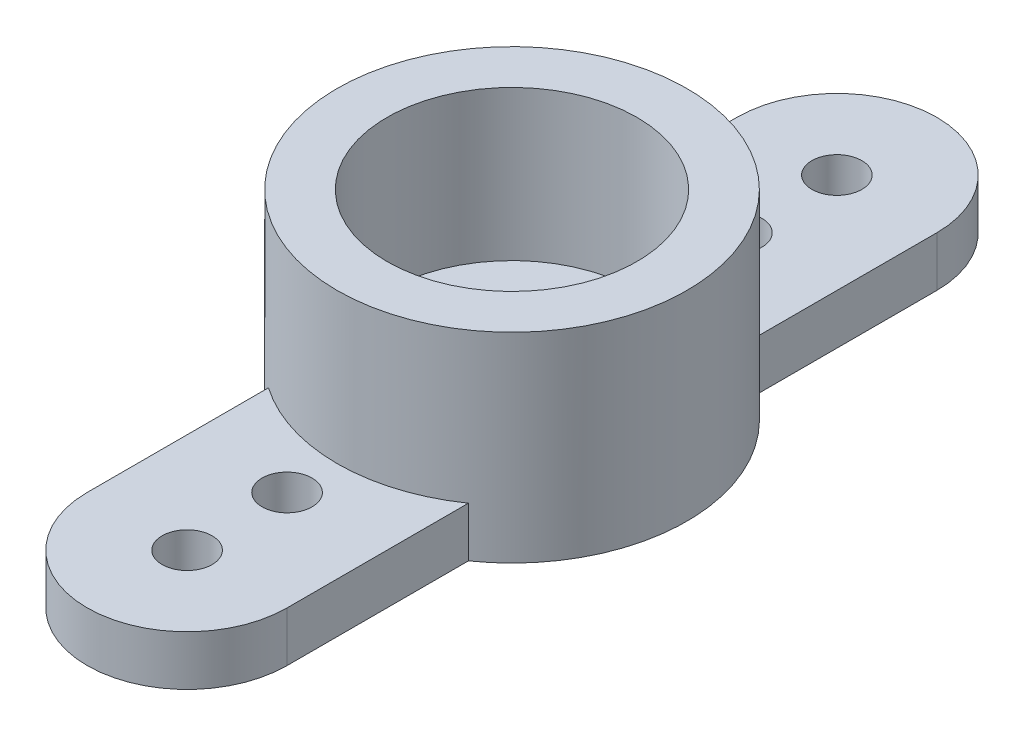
ISO-10303-21;
HEADER;
FILE_DESCRIPTION(('STEP AP214'),'2;1');
FILE_NAME('part.step','',(''),(''),'','','');
FILE_SCHEMA(('AUTOMOTIVE_DESIGN { 1 0 10303 214 1 1 1 1 }'));
ENDSEC;
DATA;
#1=APPLICATION_CONTEXT('core data for automotive mechanical design processes');
#2=APPLICATION_PROTOCOL_DEFINITION('international standard','automotive_design',2000,#1);
#3=PRODUCT_CONTEXT('',#1,'mechanical');
#4=PRODUCT('Part','Part','',(#3));
#5=PRODUCT_RELATED_PRODUCT_CATEGORY('part','',(#4));
#6=PRODUCT_DEFINITION_FORMATION('','',#4);
#7=PRODUCT_DEFINITION_CONTEXT('part definition',#1,'design');
#8=PRODUCT_DEFINITION('design','',#6,#7);
#9=PRODUCT_DEFINITION_SHAPE('','',#8);
#10=(LENGTH_UNIT() NAMED_UNIT(*) SI_UNIT(.MILLI.,.METRE.));
#11=(NAMED_UNIT(*) PLANE_ANGLE_UNIT() SI_UNIT($,.RADIAN.));
#12=(NAMED_UNIT(*) SI_UNIT($,.STERADIAN.) SOLID_ANGLE_UNIT());
#13=UNCERTAINTY_MEASURE_WITH_UNIT(LENGTH_MEASURE(1.E-05),#10,'distance_accuracy_value','');
#14=(GEOMETRIC_REPRESENTATION_CONTEXT(3) GLOBAL_UNCERTAINTY_ASSIGNED_CONTEXT((#13)) GLOBAL_UNIT_ASSIGNED_CONTEXT((#10,
#11,#12)) REPRESENTATION_CONTEXT('',''));
#15=CARTESIAN_POINT('',(0.,0.,0.));
#16=DIRECTION('',(0.,0.,1.));
#17=DIRECTION('',(1.,0.,0.));
#18=AXIS2_PLACEMENT_3D('',#15,#16,#17);
#19=CARTESIAN_POINT('',(0.,4.,0.));
#20=DIRECTION('',(0.,-1.,0.));
#21=DIRECTION('',(0.,0.,-1.));
#22=AXIS2_PLACEMENT_3D('',#19,#20,#21);
#23=CYLINDRICAL_SURFACE('',#22,3.5);
#24=CARTESIAN_POINT('',(0.,4.,0.));
#25=DIRECTION('',(0.,1.,0.));
#26=DIRECTION('',(0.,0.,1.));
#27=AXIS2_PLACEMENT_3D('',#24,#25,#26);
#28=CIRCLE('',#27,3.5);
#29=CARTESIAN_POINT('',(0.,4.,3.5));
#30=VERTEX_POINT('',#29);
#31=EDGE_CURVE('E40',#30,#30,#28,.T.);
#32=ORIENTED_EDGE('',*,*,#31,.F.);
#33=EDGE_LOOP('',(#32));
#34=FACE_BOUND('',#33,.T.);
#35=DIRECTION('',(0.,-1.,0.));
#36=VECTOR('',#35,1.);
#37=CARTESIAN_POINT('',(2.,1.,2.87228132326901));
#38=LINE('',#37,#36);
#39=CARTESIAN_POINT('',(2.,1.,2.87228132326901));
#40=VERTEX_POINT('',#39);
#41=CARTESIAN_POINT('',(2.,0.,2.87228132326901));
#42=VERTEX_POINT('',#41);
#43=EDGE_CURVE('E103',#40,#42,#38,.T.);
#44=ORIENTED_EDGE('',*,*,#43,.T.);
#45=CARTESIAN_POINT('',(0.,0.,0.));
#46=DIRECTION('',(0.,1.,0.));
#47=DIRECTION('',(0.,0.,1.));
#48=AXIS2_PLACEMENT_3D('',#45,#46,#47);
#49=CIRCLE('',#48,3.5);
#50=CARTESIAN_POINT('',(2.,0.,-2.87228132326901));
#51=VERTEX_POINT('',#50);
#52=EDGE_CURVE('E155',#42,#51,#49,.T.);
#53=ORIENTED_EDGE('',*,*,#52,.T.);
#54=DIRECTION('',(0.,-1.,0.));
#55=VECTOR('',#54,1.);
#56=CARTESIAN_POINT('',(2.,1.,-2.87228132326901));
#57=LINE('',#56,#55);
#58=CARTESIAN_POINT('',(2.,1.,-2.87228132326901));
#59=VERTEX_POINT('',#58);
#60=EDGE_CURVE('E149',#59,#51,#57,.T.);
#61=ORIENTED_EDGE('',*,*,#60,.F.);
#62=CARTESIAN_POINT('',(0.,1.,0.));
#63=DIRECTION('',(0.,-1.,0.));
#64=DIRECTION('',(0.,0.,1.));
#65=AXIS2_PLACEMENT_3D('',#62,#63,#64);
#66=CIRCLE('',#65,3.5);
#67=CARTESIAN_POINT('',(-2.,1.,-2.87228132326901));
#68=VERTEX_POINT('',#67);
#69=EDGE_CURVE('E126',#68,#59,#66,.T.);
#70=ORIENTED_EDGE('',*,*,#69,.F.);
#71=DIRECTION('',(0.,-1.,0.));
#72=VECTOR('',#71,1.);
#73=CARTESIAN_POINT('',(-2.,1.,-2.87228132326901));
#74=LINE('',#73,#72);
#75=CARTESIAN_POINT('',(-2.,0.,-2.87228132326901));
#76=VERTEX_POINT('',#75);
#77=EDGE_CURVE('E136',#68,#76,#74,.T.);
#78=ORIENTED_EDGE('',*,*,#77,.T.);
#79=CARTESIAN_POINT('',(-2.,0.,2.87228132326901));
#80=VERTEX_POINT('',#79);
#81=EDGE_CURVE('E157',#76,#80,#49,.T.);
#82=ORIENTED_EDGE('',*,*,#81,.T.);
#83=DIRECTION('',(0.,-1.,0.));
#84=VECTOR('',#83,1.);
#85=CARTESIAN_POINT('',(-2.,1.,2.87228132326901));
#86=LINE('',#85,#84);
#87=CARTESIAN_POINT('',(-2.,1.,2.87228132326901));
#88=VERTEX_POINT('',#87);
#89=EDGE_CURVE('E52',#88,#80,#86,.T.);
#90=ORIENTED_EDGE('',*,*,#89,.F.);
#91=CARTESIAN_POINT('',(0.,1.,0.));
#92=DIRECTION('',(0.,-1.,0.));
#93=DIRECTION('',(0.,0.,1.));
#94=AXIS2_PLACEMENT_3D('',#91,#92,#93);
#95=CIRCLE('',#94,3.5);
#96=EDGE_CURVE('E47',#40,#88,#95,.T.);
#97=ORIENTED_EDGE('',*,*,#96,.F.);
#98=EDGE_LOOP('',(#44,#53,#61,#70,#78,#82,#90,#97));
#99=FACE_BOUND('',#98,.T.);
#100=ADVANCED_FACE('F33',(#34,#99),#23,.T.);
#101=CARTESIAN_POINT('',(0.,4.,0.));
#102=DIRECTION('',(0.,1.,0.));
#103=DIRECTION('',(0.,0.,1.));
#104=AXIS2_PLACEMENT_3D('',#101,#102,#103);
#105=PLANE('',#104);
#106=ORIENTED_EDGE('',*,*,#31,.T.);
#107=EDGE_LOOP('',(#106));
#108=FACE_BOUND('',#107,.T.);
#109=CARTESIAN_POINT('',(0.,4.,0.));
#110=DIRECTION('',(0.,1.,0.));
#111=DIRECTION('',(0.,0.,1.));
#112=AXIS2_PLACEMENT_3D('',#109,#110,#111);
#113=CIRCLE('',#112,2.5);
#114=CARTESIAN_POINT('',(0.,4.,2.5));
#115=VERTEX_POINT('',#114);
#116=EDGE_CURVE('E152',#115,#115,#113,.T.);
#117=ORIENTED_EDGE('',*,*,#116,.F.);
#118=EDGE_LOOP('',(#117));
#119=FACE_BOUND('',#118,.T.);
#120=ADVANCED_FACE('F229',(#108,#119),#105,.T.);
#121=CARTESIAN_POINT('',(0.,0.,0.));
#122=DIRECTION('',(0.,1.,0.));
#123=DIRECTION('',(0.,0.,1.));
#124=AXIS2_PLACEMENT_3D('',#121,#122,#123);
#125=PLANE('',#124);
#126=CARTESIAN_POINT('',(0.,0.,-6.5));
#127=DIRECTION('',(0.,1.,0.));
#128=DIRECTION('',(0.,0.,1.));
#129=AXIS2_PLACEMENT_3D('',#126,#127,#128);
#130=CIRCLE('',#129,0.5);
#131=CARTESIAN_POINT('',(0.,0.,-6.));
#132=VERTEX_POINT('',#131);
#133=EDGE_CURVE('E186',#132,#132,#130,.T.);
#134=ORIENTED_EDGE('',*,*,#133,.T.);
#135=EDGE_LOOP('',(#134));
#136=FACE_BOUND('',#135,.T.);
#137=CARTESIAN_POINT('',(0.,0.,-4.5));
#138=DIRECTION('',(0.,1.,0.));
#139=DIRECTION('',(0.,0.,1.));
#140=AXIS2_PLACEMENT_3D('',#137,#138,#139);
#141=CIRCLE('',#140,0.5);
#142=CARTESIAN_POINT('',(0.,0.,-4.));
#143=VERTEX_POINT('',#142);
#144=EDGE_CURVE('E193',#143,#143,#141,.T.);
#145=ORIENTED_EDGE('',*,*,#144,.T.);
#146=EDGE_LOOP('',(#145));
#147=FACE_BOUND('',#146,.T.);
#148=CARTESIAN_POINT('',(0.,0.,4.5));
#149=DIRECTION('',(0.,1.,0.));
#150=DIRECTION('',(0.,0.,-1.));
#151=AXIS2_PLACEMENT_3D('',#148,#149,#150);
#152=CIRCLE('',#151,0.5);
#153=CARTESIAN_POINT('',(0.,0.,4.));
#154=VERTEX_POINT('',#153);
#155=EDGE_CURVE('E201',#154,#154,#152,.T.);
#156=ORIENTED_EDGE('',*,*,#155,.T.);
#157=EDGE_LOOP('',(#156));
#158=FACE_BOUND('',#157,.T.);
#159=CARTESIAN_POINT('',(0.,0.,6.5));
#160=DIRECTION('',(0.,1.,0.));
#161=DIRECTION('',(0.,0.,-1.));
#162=AXIS2_PLACEMENT_3D('',#159,#160,#161);
#163=CIRCLE('',#162,0.5);
#164=CARTESIAN_POINT('',(0.,0.,6.));
#165=VERTEX_POINT('',#164);
#166=EDGE_CURVE('E207',#165,#165,#163,.T.);
#167=ORIENTED_EDGE('',*,*,#166,.T.);
#168=EDGE_LOOP('',(#167));
#169=FACE_BOUND('',#168,.T.);
#170=ORIENTED_EDGE('',*,*,#81,.F.);
#171=DIRECTION('',(0.,0.,1.));
#172=VECTOR('',#171,1.);
#173=CARTESIAN_POINT('',(-2.,0.,-2.87228132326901));
#174=LINE('',#173,#172);
#175=CARTESIAN_POINT('',(-2.,0.,-6.5));
#176=VERTEX_POINT('',#175);
#177=EDGE_CURVE('E130',#176,#76,#174,.T.);
#178=ORIENTED_EDGE('',*,*,#177,.F.);
#179=CARTESIAN_POINT('',(0.,0.,-6.5));
#180=DIRECTION('',(0.,1.,0.));
#181=DIRECTION('',(0.,0.,-1.));
#182=AXIS2_PLACEMENT_3D('',#179,#180,#181);
#183=CIRCLE('',#182,2.);
#184=CARTESIAN_POINT('',(2.,0.,-6.5));
#185=VERTEX_POINT('',#184);
#186=EDGE_CURVE('E121',#185,#176,#183,.T.);
#187=ORIENTED_EDGE('',*,*,#186,.F.);
#188=DIRECTION('',(0.,0.,-1.));
#189=VECTOR('',#188,1.);
#190=CARTESIAN_POINT('',(2.,0.,-6.5));
#191=LINE('',#190,#189);
#192=EDGE_CURVE('E119',#51,#185,#191,.T.);
#193=ORIENTED_EDGE('',*,*,#192,.F.);
#194=ORIENTED_EDGE('',*,*,#52,.F.);
#195=DIRECTION('',(0.,0.,-1.));
#196=VECTOR('',#195,1.);
#197=CARTESIAN_POINT('',(2.,0.,6.5));
#198=LINE('',#197,#196);
#199=CARTESIAN_POINT('',(2.,0.,6.5));
#200=VERTEX_POINT('',#199);
#201=EDGE_CURVE('E177',#200,#42,#198,.T.);
#202=ORIENTED_EDGE('',*,*,#201,.F.);
#203=CARTESIAN_POINT('',(0.,0.,6.5));
#204=DIRECTION('',(0.,1.,0.));
#205=DIRECTION('',(0.,0.,1.));
#206=AXIS2_PLACEMENT_3D('',#203,#204,#205);
#207=CIRCLE('',#206,2.);
#208=CARTESIAN_POINT('',(-2.,0.,6.5));
#209=VERTEX_POINT('',#208);
#210=EDGE_CURVE('E118',#209,#200,#207,.T.);
#211=ORIENTED_EDGE('',*,*,#210,.F.);
#212=DIRECTION('',(0.,0.,1.));
#213=VECTOR('',#212,1.);
#214=CARTESIAN_POINT('',(-2.,0.,2.87228132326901));
#215=LINE('',#214,#213);
#216=EDGE_CURVE('E114',#80,#209,#215,.T.);
#217=ORIENTED_EDGE('',*,*,#216,.F.);
#218=EDGE_LOOP('',(#170,#178,#187,#193,#194,#202,#211,#217));
#219=FACE_BOUND('',#218,.T.);
#220=ADVANCED_FACE('F162',(#136,#147,#158,#169,#219),#125,.F.);
#221=CARTESIAN_POINT('',(0.,4.,0.));
#222=DIRECTION('',(0.,-1.,0.));
#223=DIRECTION('',(0.,0.,-1.));
#224=AXIS2_PLACEMENT_3D('',#221,#222,#223);
#225=CYLINDRICAL_SURFACE('',#224,2.5);
#226=CARTESIAN_POINT('',(0.,1.,0.));
#227=DIRECTION('',(0.,1.,0.));
#228=DIRECTION('',(0.,0.,1.));
#229=AXIS2_PLACEMENT_3D('',#226,#227,#228);
#230=CIRCLE('',#229,2.5);
#231=CARTESIAN_POINT('',(0.,1.,2.5));
#232=VERTEX_POINT('',#231);
#233=EDGE_CURVE('E11',#232,#232,#230,.T.);
#234=ORIENTED_EDGE('',*,*,#233,.F.);
#235=EDGE_LOOP('',(#234));
#236=FACE_BOUND('',#235,.T.);
#237=ORIENTED_EDGE('',*,*,#116,.T.);
#238=EDGE_LOOP('',(#237));
#239=FACE_BOUND('',#238,.T.);
#240=ADVANCED_FACE('F240',(#236,#239),#225,.F.);
#241=CARTESIAN_POINT('',(2.,1.,-6.5));
#242=DIRECTION('',(-1.,0.,0.));
#243=DIRECTION('',(0.,0.,1.));
#244=AXIS2_PLACEMENT_3D('',#241,#242,#243);
#245=PLANE('',#244);
#246=ORIENTED_EDGE('',*,*,#192,.T.);
#247=DIRECTION('',(0.,-1.,0.));
#248=VECTOR('',#247,1.);
#249=CARTESIAN_POINT('',(2.,1.,-6.5));
#250=LINE('',#249,#248);
#251=CARTESIAN_POINT('',(2.,1.,-6.5));
#252=VERTEX_POINT('',#251);
#253=EDGE_CURVE('E146',#252,#185,#250,.T.);
#254=ORIENTED_EDGE('',*,*,#253,.F.);
#255=DIRECTION('',(0.,0.,-1.));
#256=VECTOR('',#255,1.);
#257=CARTESIAN_POINT('',(2.,1.,-6.5));
#258=LINE('',#257,#256);
#259=EDGE_CURVE('E129',#59,#252,#258,.T.);
#260=ORIENTED_EDGE('',*,*,#259,.F.);
#261=ORIENTED_EDGE('',*,*,#60,.T.);
#262=EDGE_LOOP('',(#246,#254,#260,#261));
#263=FACE_BOUND('',#262,.T.);
#264=ADVANCED_FACE('F166',(#263),#245,.F.);
#265=CARTESIAN_POINT('',(0.,1.,-6.5));
#266=DIRECTION('',(0.,-1.,0.));
#267=DIRECTION('',(0.,0.,-1.));
#268=AXIS2_PLACEMENT_3D('',#265,#266,#267);
#269=CYLINDRICAL_SURFACE('',#268,2.);
#270=ORIENTED_EDGE('',*,*,#186,.T.);
#271=DIRECTION('',(0.,-1.,0.));
#272=VECTOR('',#271,1.);
#273=CARTESIAN_POINT('',(-2.,1.,-6.5));
#274=LINE('',#273,#272);
#275=CARTESIAN_POINT('',(-2.,1.,-6.5));
#276=VERTEX_POINT('',#275);
#277=EDGE_CURVE('E143',#276,#176,#274,.T.);
#278=ORIENTED_EDGE('',*,*,#277,.F.);
#279=CARTESIAN_POINT('',(0.,1.,-6.5));
#280=DIRECTION('',(0.,1.,0.));
#281=DIRECTION('',(0.,0.,-1.));
#282=AXIS2_PLACEMENT_3D('',#279,#280,#281);
#283=CIRCLE('',#282,2.);
#284=EDGE_CURVE('E132',#252,#276,#283,.T.);
#285=ORIENTED_EDGE('',*,*,#284,.F.);
#286=ORIENTED_EDGE('',*,*,#253,.T.);
#287=EDGE_LOOP('',(#270,#278,#285,#286));
#288=FACE_BOUND('',#287,.T.);
#289=ADVANCED_FACE('F248',(#288),#269,.T.);
#290=CARTESIAN_POINT('',(-2.,1.,-2.87228132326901));
#291=DIRECTION('',(1.,0.,0.));
#292=DIRECTION('',(0.,0.,-1.));
#293=AXIS2_PLACEMENT_3D('',#290,#291,#292);
#294=PLANE('',#293);
#295=ORIENTED_EDGE('',*,*,#177,.T.);
#296=ORIENTED_EDGE('',*,*,#77,.F.);
#297=DIRECTION('',(0.,0.,1.));
#298=VECTOR('',#297,1.);
#299=CARTESIAN_POINT('',(-2.,1.,-2.87228132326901));
#300=LINE('',#299,#298);
#301=EDGE_CURVE('E134',#276,#68,#300,.T.);
#302=ORIENTED_EDGE('',*,*,#301,.F.);
#303=ORIENTED_EDGE('',*,*,#277,.T.);
#304=EDGE_LOOP('',(#295,#296,#302,#303));
#305=FACE_BOUND('',#304,.T.);
#306=ADVANCED_FACE('F173',(#305),#294,.F.);
#307=CARTESIAN_POINT('',(0.,1.,0.));
#308=DIRECTION('',(0.,1.,0.));
#309=DIRECTION('',(0.,0.,1.));
#310=AXIS2_PLACEMENT_3D('',#307,#308,#309);
#311=PLANE('',#310);
#312=CARTESIAN_POINT('',(0.,1.,-6.5));
#313=DIRECTION('',(0.,1.,0.));
#314=DIRECTION('',(0.,0.,1.));
#315=AXIS2_PLACEMENT_3D('',#312,#313,#314);
#316=CIRCLE('',#315,0.5);
#317=CARTESIAN_POINT('',(0.,1.,-6.));
#318=VERTEX_POINT('',#317);
#319=EDGE_CURVE('E188',#318,#318,#316,.T.);
#320=ORIENTED_EDGE('',*,*,#319,.F.);
#321=EDGE_LOOP('',(#320));
#322=FACE_BOUND('',#321,.T.);
#323=CARTESIAN_POINT('',(0.,1.,-4.5));
#324=DIRECTION('',(0.,1.,0.));
#325=DIRECTION('',(0.,0.,1.));
#326=AXIS2_PLACEMENT_3D('',#323,#324,#325);
#327=CIRCLE('',#326,0.5);
#328=CARTESIAN_POINT('',(0.,1.,-4.));
#329=VERTEX_POINT('',#328);
#330=EDGE_CURVE('E198',#329,#329,#327,.T.);
#331=ORIENTED_EDGE('',*,*,#330,.F.);
#332=EDGE_LOOP('',(#331));
#333=FACE_BOUND('',#332,.T.);
#334=ORIENTED_EDGE('',*,*,#69,.T.);
#335=ORIENTED_EDGE('',*,*,#259,.T.);
#336=ORIENTED_EDGE('',*,*,#284,.T.);
#337=ORIENTED_EDGE('',*,*,#301,.T.);
#338=EDGE_LOOP('',(#334,#335,#336,#337));
#339=FACE_BOUND('',#338,.T.);
#340=ADVANCED_FACE('F169',(#322,#333,#339),#311,.T.);
#341=CARTESIAN_POINT('',(0.,1.,6.5));
#342=DIRECTION('',(0.,-1.,0.));
#343=DIRECTION('',(0.,0.,-1.));
#344=AXIS2_PLACEMENT_3D('',#341,#342,#343);
#345=CYLINDRICAL_SURFACE('',#344,2.);
#346=ORIENTED_EDGE('',*,*,#210,.T.);
#347=DIRECTION('',(0.,-1.,0.));
#348=VECTOR('',#347,1.);
#349=CARTESIAN_POINT('',(2.,1.,6.5));
#350=LINE('',#349,#348);
#351=CARTESIAN_POINT('',(2.,1.,6.5));
#352=VERTEX_POINT('',#351);
#353=EDGE_CURVE('E101',#352,#200,#350,.T.);
#354=ORIENTED_EDGE('',*,*,#353,.F.);
#355=CARTESIAN_POINT('',(0.,1.,6.5));
#356=DIRECTION('',(0.,1.,0.));
#357=DIRECTION('',(0.,0.,1.));
#358=AXIS2_PLACEMENT_3D('',#355,#356,#357);
#359=CIRCLE('',#358,2.);
#360=CARTESIAN_POINT('',(-2.,1.,6.5));
#361=VERTEX_POINT('',#360);
#362=EDGE_CURVE('E105',#361,#352,#359,.T.);
#363=ORIENTED_EDGE('',*,*,#362,.F.);
#364=DIRECTION('',(0.,-1.,0.));
#365=VECTOR('',#364,1.);
#366=CARTESIAN_POINT('',(-2.,1.,6.5));
#367=LINE('',#366,#365);
#368=EDGE_CURVE('E182',#361,#209,#367,.T.);
#369=ORIENTED_EDGE('',*,*,#368,.T.);
#370=EDGE_LOOP('',(#346,#354,#363,#369));
#371=FACE_BOUND('',#370,.T.);
#372=ADVANCED_FACE('F116',(#371),#345,.T.);
#373=CARTESIAN_POINT('',(2.,1.,6.5));
#374=DIRECTION('',(-1.,0.,0.));
#375=DIRECTION('',(0.,0.,1.));
#376=AXIS2_PLACEMENT_3D('',#373,#374,#375);
#377=PLANE('',#376);
#378=ORIENTED_EDGE('',*,*,#201,.T.);
#379=ORIENTED_EDGE('',*,*,#43,.F.);
#380=DIRECTION('',(0.,0.,-1.));
#381=VECTOR('',#380,1.);
#382=CARTESIAN_POINT('',(2.,1.,6.5));
#383=LINE('',#382,#381);
#384=EDGE_CURVE('E96',#352,#40,#383,.T.);
#385=ORIENTED_EDGE('',*,*,#384,.F.);
#386=ORIENTED_EDGE('',*,*,#353,.T.);
#387=EDGE_LOOP('',(#378,#379,#385,#386));
#388=FACE_BOUND('',#387,.T.);
#389=ADVANCED_FACE('F99',(#388),#377,.F.);
#390=CARTESIAN_POINT('',(-2.,1.,2.87228132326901));
#391=DIRECTION('',(1.,0.,0.));
#392=DIRECTION('',(0.,0.,-1.));
#393=AXIS2_PLACEMENT_3D('',#390,#391,#392);
#394=PLANE('',#393);
#395=ORIENTED_EDGE('',*,*,#216,.T.);
#396=ORIENTED_EDGE('',*,*,#368,.F.);
#397=DIRECTION('',(0.,0.,1.));
#398=VECTOR('',#397,1.);
#399=CARTESIAN_POINT('',(-2.,1.,2.87228132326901));
#400=LINE('',#399,#398);
#401=EDGE_CURVE('E110',#88,#361,#400,.T.);
#402=ORIENTED_EDGE('',*,*,#401,.F.);
#403=ORIENTED_EDGE('',*,*,#89,.T.);
#404=EDGE_LOOP('',(#395,#396,#402,#403));
#405=FACE_BOUND('',#404,.T.);
#406=ADVANCED_FACE('F183',(#405),#394,.F.);
#407=CARTESIAN_POINT('',(0.,1.,6.5));
#408=DIRECTION('',(0.,1.,0.));
#409=DIRECTION('',(0.,0.,1.));
#410=AXIS2_PLACEMENT_3D('',#407,#408,#409);
#411=PLANE('',#410);
#412=CARTESIAN_POINT('',(0.,1.,4.5));
#413=DIRECTION('',(0.,1.,0.));
#414=DIRECTION('',(0.,0.,-1.));
#415=AXIS2_PLACEMENT_3D('',#412,#413,#414);
#416=CIRCLE('',#415,0.5);
#417=CARTESIAN_POINT('',(0.,1.,4.));
#418=VERTEX_POINT('',#417);
#419=EDGE_CURVE('E204',#418,#418,#416,.T.);
#420=ORIENTED_EDGE('',*,*,#419,.F.);
#421=EDGE_LOOP('',(#420));
#422=FACE_BOUND('',#421,.T.);
#423=CARTESIAN_POINT('',(0.,1.,6.5));
#424=DIRECTION('',(0.,1.,0.));
#425=DIRECTION('',(0.,0.,-1.));
#426=AXIS2_PLACEMENT_3D('',#423,#424,#425);
#427=CIRCLE('',#426,0.5);
#428=CARTESIAN_POINT('',(0.,1.,6.));
#429=VERTEX_POINT('',#428);
#430=EDGE_CURVE('E210',#429,#429,#427,.T.);
#431=ORIENTED_EDGE('',*,*,#430,.F.);
#432=EDGE_LOOP('',(#431));
#433=FACE_BOUND('',#432,.T.);
#434=ORIENTED_EDGE('',*,*,#362,.T.);
#435=ORIENTED_EDGE('',*,*,#384,.T.);
#436=ORIENTED_EDGE('',*,*,#96,.T.);
#437=ORIENTED_EDGE('',*,*,#401,.T.);
#438=EDGE_LOOP('',(#434,#435,#436,#437));
#439=FACE_BOUND('',#438,.T.);
#440=ADVANCED_FACE('F108',(#422,#433,#439),#411,.T.);
#441=CARTESIAN_POINT('',(0.,1.,0.));
#442=DIRECTION('',(0.,1.,0.));
#443=DIRECTION('',(0.,0.,1.));
#444=AXIS2_PLACEMENT_3D('',#441,#442,#443);
#445=PLANE('',#444);
#446=ORIENTED_EDGE('',*,*,#233,.T.);
#447=EDGE_LOOP('',(#446));
#448=FACE_BOUND('',#447,.T.);
#449=ADVANCED_FACE('F217',(#448),#445,.T.);
#450=CARTESIAN_POINT('',(0.,0.,6.5));
#451=DIRECTION('',(0.,1.,0.));
#452=DIRECTION('',(0.,0.,1.));
#453=AXIS2_PLACEMENT_3D('',#450,#451,#452);
#454=CYLINDRICAL_SURFACE('',#453,0.5);
#455=ORIENTED_EDGE('',*,*,#166,.F.);
#456=EDGE_LOOP('',(#455));
#457=FACE_BOUND('',#456,.T.);
#458=ORIENTED_EDGE('',*,*,#430,.T.);
#459=EDGE_LOOP('',(#458));
#460=FACE_BOUND('',#459,.T.);
#461=ADVANCED_FACE('F214',(#457,#460),#454,.F.);
#462=CARTESIAN_POINT('',(0.,0.,4.5));
#463=DIRECTION('',(0.,1.,0.));
#464=DIRECTION('',(0.,0.,1.));
#465=AXIS2_PLACEMENT_3D('',#462,#463,#464);
#466=CYLINDRICAL_SURFACE('',#465,0.5);
#467=ORIENTED_EDGE('',*,*,#155,.F.);
#468=EDGE_LOOP('',(#467));
#469=FACE_BOUND('',#468,.T.);
#470=ORIENTED_EDGE('',*,*,#419,.T.);
#471=EDGE_LOOP('',(#470));
#472=FACE_BOUND('',#471,.T.);
#473=ADVANCED_FACE('F306',(#469,#472),#466,.F.);
#474=CARTESIAN_POINT('',(0.,0.,-4.5));
#475=DIRECTION('',(0.,1.,0.));
#476=DIRECTION('',(0.,0.,1.));
#477=AXIS2_PLACEMENT_3D('',#474,#475,#476);
#478=CYLINDRICAL_SURFACE('',#477,0.5);
#479=ORIENTED_EDGE('',*,*,#144,.F.);
#480=EDGE_LOOP('',(#479));
#481=FACE_BOUND('',#480,.T.);
#482=ORIENTED_EDGE('',*,*,#330,.T.);
#483=EDGE_LOOP('',(#482));
#484=FACE_BOUND('',#483,.T.);
#485=ADVANCED_FACE('F316',(#481,#484),#478,.F.);
#486=CARTESIAN_POINT('',(0.,0.,-6.5));
#487=DIRECTION('',(0.,1.,0.));
#488=DIRECTION('',(0.,0.,1.));
#489=AXIS2_PLACEMENT_3D('',#486,#487,#488);
#490=CYLINDRICAL_SURFACE('',#489,0.5);
#491=ORIENTED_EDGE('',*,*,#133,.F.);
#492=EDGE_LOOP('',(#491));
#493=FACE_BOUND('',#492,.T.);
#494=ORIENTED_EDGE('',*,*,#319,.T.);
#495=EDGE_LOOP('',(#494));
#496=FACE_BOUND('',#495,.T.);
#497=ADVANCED_FACE('F326',(#493,#496),#490,.F.);
#498=CLOSED_SHELL('',(#100,#120,#220,#240,#264,#289,#306,#340,#372,#389,#406,#440,#449,#461,
#473,#485,#497));
#499=MANIFOLD_SOLID_BREP('B2',#498);
#500=ADVANCED_BREP_SHAPE_REPRESENTATION('',(#18,#499),#14);
#501=SHAPE_DEFINITION_REPRESENTATION(#9,#500);
ENDSEC;
END-ISO-10303-21;
